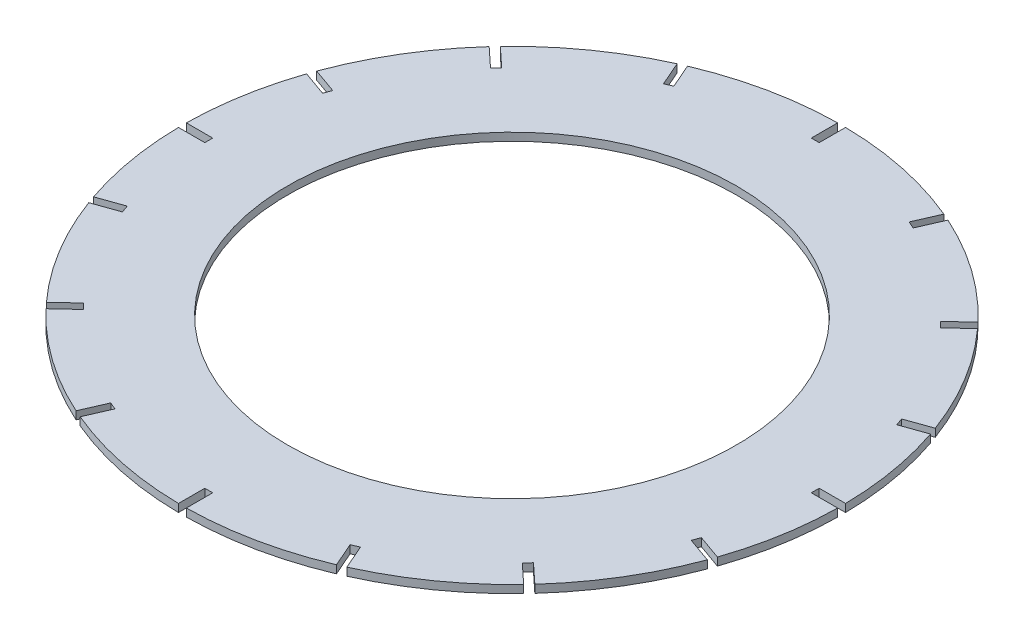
from build123d import *

# Parameters (mm, degrees)
BOSS_EXTRUDE1_DEPTH = 3
SKETCH3_R           = 85.127177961
CUT_EXTRUDE1_DEPTH  = 53.61


with BuildPart() as part:
    # Sketch2 → Boss-Extrude1 (new body)
    with BuildSketch(Plane(origin=(0, 0, 0), x_dir=(1, 0, 0), z_dir=(0, 1, 0))):
        with BuildLine():
            Line((114.990999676, 1.5), (114.990999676, -1.5))
            Line((114.990999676, -1.5), (124.990999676, -1.5))
            ThreePointArc((124.990999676, -1.5), (123.186472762, -21.215393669), (118.291813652, -40.398599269))
            Line((118.291813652, -40.398599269), (108.867932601, -37.05338389))
            Line((108.867932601, -37.05338389), (107.864367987, -39.880548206))
            Line((107.864367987, -39.880548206), (117.288249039, -43.225763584))
            ThreePointArc((117.288249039, -43.225763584), (106.908682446, -64.77293893), (92.615292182, -83.948839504))
            Line((92.615292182, -83.948839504), (85.287193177, -77.144505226))
            Line((85.287193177, -77.144505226), (83.245892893, -79.342934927))
            Line((83.245892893, -79.342934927), (90.573991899, -86.147269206))
            ThreePointArc((90.573991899, -86.147269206), (72.312023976, -101.960635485), (51.349348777, -113.965979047))
            Line((51.349348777, -113.965979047), (47.351103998, -104.800061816))
            Line((47.351103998, -104.800061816), (44.601328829, -105.99953525))
            Line((44.601328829, -105.99953525), (48.599573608, -115.165452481))
            ThreePointArc((48.599573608, -115.165452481), (25.526988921, -122.365733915), (1.5, -124.990999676))
            Line((1.5, -124.990999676), (1.5, -114.990999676))
            Line((1.5, -114.990999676), (-1.5, -114.990999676))
            Line((-1.5, -114.990999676), (-1.5, -124.990999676))
            ThreePointArc((-1.5, -124.990999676), (-25.526988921, -122.365733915), (-48.599573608, -115.165452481))
            Line((-48.599573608, -115.165452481), (-44.601328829, -105.99953525))
            Line((-44.601328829, -105.99953525), (-47.351103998, -104.800061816))
            Line((-47.351103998, -104.800061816), (-51.349348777, -113.965979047))
            ThreePointArc((-51.349348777, -113.965979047), (-72.312023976, -101.960635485), (-90.573991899, -86.147269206))
            Line((-90.573991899, -86.147269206), (-83.245892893, -79.342934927))
            Line((-83.245892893, -79.342934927), (-85.287193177, -77.144505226))
            Line((-85.287193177, -77.144505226), (-92.615292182, -83.948839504))
            ThreePointArc((-92.615292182, -83.948839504), (-106.908682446, -64.77293893), (-117.288249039, -43.225763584))
            Line((-117.288249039, -43.225763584), (-107.864367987, -39.880548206))
            Line((-107.864367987, -39.880548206), (-108.867932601, -37.05338389))
            Line((-108.867932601, -37.05338389), (-118.291813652, -40.398599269))
            ThreePointArc((-118.291813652, -40.398599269), (-123.186472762, -21.215393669), (-124.990999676, -1.5))
            Line((-124.990999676, -1.5), (-114.990999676, -1.5))
            Line((-114.990999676, -1.5), (-114.990999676, 1.5))
            Line((-114.990999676, 1.5), (-124.990999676, 1.5))
            ThreePointArc((-124.990999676, 1.5), (-123.186472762, 21.215393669), (-118.291813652, 40.398599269))
            Line((-118.291813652, 40.398599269), (-108.867932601, 37.05338389))
            Line((-108.867932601, 37.05338389), (-107.864367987, 39.880548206))
            Line((-107.864367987, 39.880548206), (-117.288249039, 43.225763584))
            ThreePointArc((-117.288249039, 43.225763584), (-106.908682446, 64.77293893), (-92.615292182, 83.948839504))
            Line((-92.615292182, 83.948839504), (-85.287193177, 77.144505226))
            Line((-85.287193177, 77.144505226), (-83.245892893, 79.342934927))
            Line((-83.245892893, 79.342934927), (-90.573991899, 86.147269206))
            ThreePointArc((-90.573991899, 86.147269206), (-72.312023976, 101.960635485), (-51.349348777, 113.965979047))
            Line((-51.349348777, 113.965979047), (-47.351103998, 104.800061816))
            Line((-47.351103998, 104.800061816), (-44.601328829, 105.99953525))
            Line((-44.601328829, 105.99953525), (-48.599573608, 115.165452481))
            ThreePointArc((-48.599573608, 115.165452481), (-25.526988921, 122.365733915), (-1.5, 124.990999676))
            Line((-1.5, 124.990999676), (-1.5, 114.990999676))
            Line((-1.5, 114.990999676), (1.5, 114.990999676))
            Line((1.5, 114.990999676), (1.5, 124.990999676))
            ThreePointArc((1.5, 124.990999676), (25.526988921, 122.365733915), (48.599573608, 115.165452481))
            Line((48.599573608, 115.165452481), (44.601328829, 105.99953525))
            Line((44.601328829, 105.99953525), (47.351103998, 104.800061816))
            Line((47.351103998, 104.800061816), (51.349348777, 113.965979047))
            ThreePointArc((51.349348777, 113.965979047), (72.312023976, 101.960635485), (90.573991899, 86.147269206))
            Line((90.573991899, 86.147269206), (83.245892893, 79.342934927))
            Line((83.245892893, 79.342934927), (85.287193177, 77.144505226))
            Line((85.287193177, 77.144505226), (92.615292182, 83.948839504))
            ThreePointArc((92.615292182, 83.948839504), (106.908682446, 64.77293893), (117.288249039, 43.225763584))
            Line((117.288249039, 43.225763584), (107.864367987, 39.880548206))
            Line((107.864367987, 39.880548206), (108.867932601, 37.05338389))
            Line((108.867932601, 37.05338389), (118.291813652, 40.398599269))
            ThreePointArc((118.291813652, 40.398599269), (123.186472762, 21.215393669), (124.990999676, 1.5))
            Line((124.990999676, 1.5), (114.990999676, 1.5))
        make_face()
    extrude(amount=BOSS_EXTRUDE1_DEPTH)

    # Sketch3 → Cut-Extrude1 (cut)
    with BuildSketch(Plane.XZ):
        with Locations(Location((0, 0, 0), (0, 0, 270))):
            Circle(SKETCH3_R)
    extrude(amount=-CUT_EXTRUDE1_DEPTH, mode=Mode.SUBTRACT)


solid = part.part
